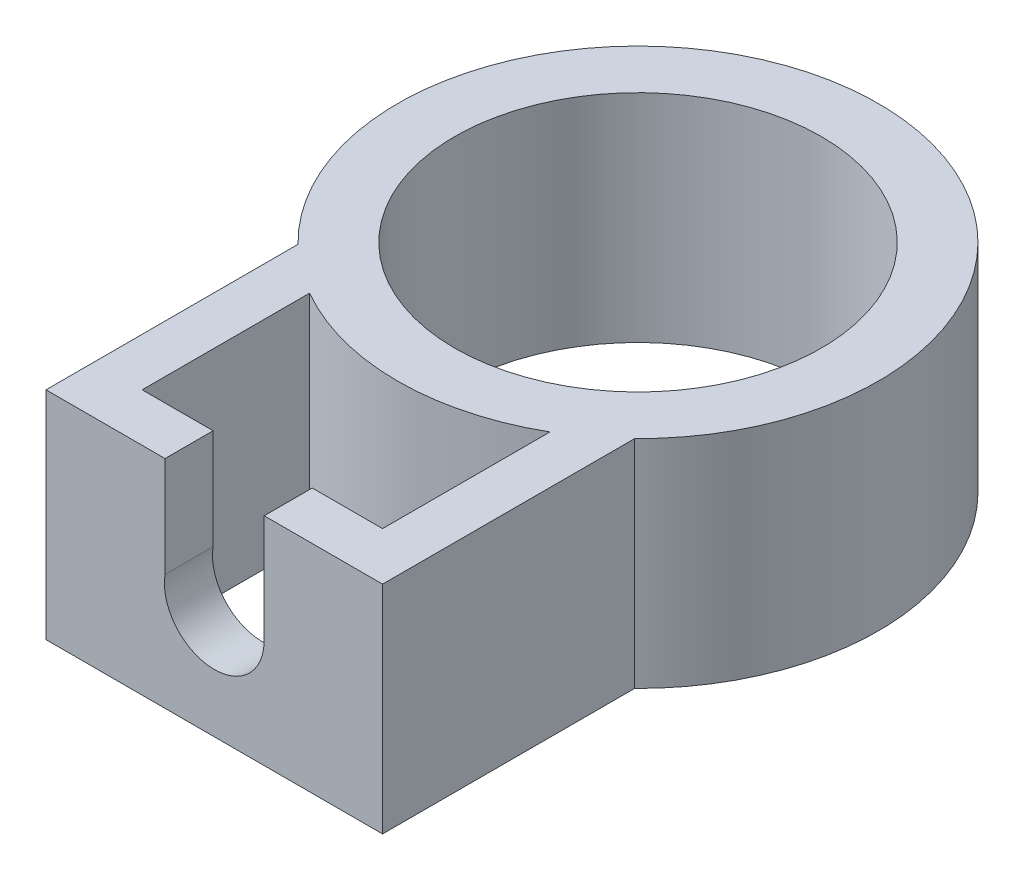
ISO-10303-21;
HEADER;
FILE_DESCRIPTION(('STEP AP214'),'2;1');
FILE_NAME('part.step','',(''),(''),'','','');
FILE_SCHEMA(('AUTOMOTIVE_DESIGN { 1 0 10303 214 1 1 1 1 }'));
ENDSEC;
DATA;
#1=APPLICATION_CONTEXT('core data for automotive mechanical design processes');
#2=APPLICATION_PROTOCOL_DEFINITION('international standard','automotive_design',2000,#1);
#3=PRODUCT_CONTEXT('',#1,'mechanical');
#4=PRODUCT('Part','Part','',(#3));
#5=PRODUCT_RELATED_PRODUCT_CATEGORY('part','',(#4));
#6=PRODUCT_DEFINITION_FORMATION('','',#4);
#7=PRODUCT_DEFINITION_CONTEXT('part definition',#1,'design');
#8=PRODUCT_DEFINITION('design','',#6,#7);
#9=PRODUCT_DEFINITION_SHAPE('','',#8);
#10=(LENGTH_UNIT() NAMED_UNIT(*) SI_UNIT(.MILLI.,.METRE.));
#11=(NAMED_UNIT(*) PLANE_ANGLE_UNIT() SI_UNIT($,.RADIAN.));
#12=(NAMED_UNIT(*) SI_UNIT($,.STERADIAN.) SOLID_ANGLE_UNIT());
#13=UNCERTAINTY_MEASURE_WITH_UNIT(LENGTH_MEASURE(1.E-05),#10,'distance_accuracy_value','');
#14=(GEOMETRIC_REPRESENTATION_CONTEXT(3) GLOBAL_UNCERTAINTY_ASSIGNED_CONTEXT((#13)) GLOBAL_UNIT_ASSIGNED_CONTEXT((#10,
#11,#12)) REPRESENTATION_CONTEXT('',''));
#15=CARTESIAN_POINT('',(0.,0.,0.));
#16=DIRECTION('',(0.,0.,1.));
#17=DIRECTION('',(1.,0.,0.));
#18=AXIS2_PLACEMENT_3D('',#15,#16,#17);
#19=CARTESIAN_POINT('',(0.,18.,0.));
#20=DIRECTION('',(0.,1.,0.));
#21=DIRECTION('',(0.,0.,1.));
#22=AXIS2_PLACEMENT_3D('',#19,#20,#21);
#23=PLANE('',#22);
#24=DIRECTION('',(0.,0.,-1.));
#25=VECTOR('',#24,1.);
#26=CARTESIAN_POINT('',(4.15,18.,0.));
#27=LINE('',#26,#25);
#28=CARTESIAN_POINT('',(4.15,18.,35.25));
#29=VERTEX_POINT('',#28);
#30=CARTESIAN_POINT('',(4.15,18.,31.25));
#31=VERTEX_POINT('',#30);
#32=EDGE_CURVE('E146',#29,#31,#27,.T.);
#33=ORIENTED_EDGE('',*,*,#32,.F.);
#34=DIRECTION('',(1.,0.,0.));
#35=VECTOR('',#34,1.);
#36=CARTESIAN_POINT('',(6.5,18.,35.25));
#37=LINE('',#36,#35);
#38=CARTESIAN_POINT('',(14.,18.,35.25));
#39=VERTEX_POINT('',#38);
#40=EDGE_CURVE('E240',#29,#39,#37,.T.);
#41=ORIENTED_EDGE('',*,*,#40,.T.);
#42=DIRECTION('',(0.,0.,-1.));
#43=VECTOR('',#42,1.);
#44=CARTESIAN_POINT('',(14.,18.,35.25));
#45=LINE('',#44,#43);
#46=CARTESIAN_POINT('',(14.,18.,14.2828568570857));
#47=VERTEX_POINT('',#46);
#48=EDGE_CURVE('E239',#39,#47,#45,.T.);
#49=ORIENTED_EDGE('',*,*,#48,.T.);
#50=CARTESIAN_POINT('',(0.,18.,0.));
#51=DIRECTION('',(0.,1.,0.));
#52=DIRECTION('',(0.,0.,1.));
#53=AXIS2_PLACEMENT_3D('',#50,#51,#52);
#54=CIRCLE('',#53,20.);
#55=CARTESIAN_POINT('',(-14.,18.,14.2828568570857));
#56=VERTEX_POINT('',#55);
#57=EDGE_CURVE('E243',#47,#56,#54,.T.);
#58=ORIENTED_EDGE('',*,*,#57,.T.);
#59=DIRECTION('',(0.,0.,1.));
#60=VECTOR('',#59,1.);
#61=CARTESIAN_POINT('',(-14.,18.,35.25));
#62=LINE('',#61,#60);
#63=CARTESIAN_POINT('',(-14.,18.,35.25));
#64=VERTEX_POINT('',#63);
#65=EDGE_CURVE('E246',#56,#64,#62,.T.);
#66=ORIENTED_EDGE('',*,*,#65,.T.);
#67=CARTESIAN_POINT('',(-4.09784403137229,18.,35.25));
#68=VERTEX_POINT('',#67);
#69=EDGE_CURVE('E235',#64,#68,#37,.T.);
#70=ORIENTED_EDGE('',*,*,#69,.T.);
#71=DIRECTION('',(0.,0.,1.));
#72=VECTOR('',#71,1.);
#73=CARTESIAN_POINT('',(-4.09784403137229,18.,0.));
#74=LINE('',#73,#72);
#75=CARTESIAN_POINT('',(-4.09784403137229,18.,31.25));
#76=VERTEX_POINT('',#75);
#77=EDGE_CURVE('E171',#76,#68,#74,.T.);
#78=ORIENTED_EDGE('',*,*,#77,.F.);
#79=DIRECTION('',(1.,0.,0.));
#80=VECTOR('',#79,1.);
#81=CARTESIAN_POINT('',(-9.99999999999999,18.,31.25));
#82=LINE('',#81,#80);
#83=CARTESIAN_POINT('',(-9.99999999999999,18.,31.25));
#84=VERTEX_POINT('',#83);
#85=EDGE_CURVE('E189',#84,#76,#82,.T.);
#86=ORIENTED_EDGE('',*,*,#85,.F.);
#87=DIRECTION('',(0.,0.,1.));
#88=VECTOR('',#87,1.);
#89=CARTESIAN_POINT('',(-9.99999999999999,18.,31.25));
#90=LINE('',#89,#88);
#91=CARTESIAN_POINT('',(-9.99999999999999,18.,17.3205080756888));
#92=VERTEX_POINT('',#91);
#93=EDGE_CURVE('E184',#92,#84,#90,.T.);
#94=ORIENTED_EDGE('',*,*,#93,.F.);
#95=CARTESIAN_POINT('',(0.,18.,0.));
#96=DIRECTION('',(0.,-1.,0.));
#97=DIRECTION('',(0.,0.,1.));
#98=AXIS2_PLACEMENT_3D('',#95,#96,#97);
#99=CIRCLE('',#98,20.);
#100=CARTESIAN_POINT('',(10.,18.,17.3205080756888));
#101=VERTEX_POINT('',#100);
#102=EDGE_CURVE('E181',#101,#92,#99,.T.);
#103=ORIENTED_EDGE('',*,*,#102,.F.);
#104=DIRECTION('',(0.,0.,-1.));
#105=VECTOR('',#104,1.);
#106=CARTESIAN_POINT('',(10.,18.,31.25));
#107=LINE('',#106,#105);
#108=CARTESIAN_POINT('',(10.,18.,31.25));
#109=VERTEX_POINT('',#108);
#110=EDGE_CURVE('E193',#109,#101,#107,.T.);
#111=ORIENTED_EDGE('',*,*,#110,.F.);
#112=EDGE_CURVE('E188',#31,#109,#82,.T.);
#113=ORIENTED_EDGE('',*,*,#112,.F.);
#114=EDGE_LOOP('',(#33,#41,#49,#58,#66,#70,#78,#86,#94,#103,#111,#113));
#115=FACE_BOUND('',#114,.T.);
#116=CARTESIAN_POINT('',(0.,18.,0.));
#117=DIRECTION('',(0.,1.,0.));
#118=DIRECTION('',(0.,0.,1.));
#119=AXIS2_PLACEMENT_3D('',#116,#117,#118);
#120=CIRCLE('',#119,15.25);
#121=CARTESIAN_POINT('',(0.,18.,15.25));
#122=VERTEX_POINT('',#121);
#123=EDGE_CURVE('E227',#122,#122,#120,.T.);
#124=ORIENTED_EDGE('',*,*,#123,.F.);
#125=EDGE_LOOP('',(#124));
#126=FACE_BOUND('',#125,.T.);
#127=ADVANCED_FACE('F45',(#115,#126),#23,.T.);
#128=CARTESIAN_POINT('',(0.,0.,0.));
#129=DIRECTION('',(0.,1.,0.));
#130=DIRECTION('',(0.,0.,1.));
#131=AXIS2_PLACEMENT_3D('',#128,#129,#130);
#132=PLANE('',#131);
#133=CARTESIAN_POINT('',(0.,0.,0.));
#134=DIRECTION('',(0.,1.,0.));
#135=DIRECTION('',(0.,0.,1.));
#136=AXIS2_PLACEMENT_3D('',#133,#134,#135);
#137=CIRCLE('',#136,15.25);
#138=CARTESIAN_POINT('',(0.,0.,15.25));
#139=VERTEX_POINT('',#138);
#140=EDGE_CURVE('E226',#139,#139,#137,.T.);
#141=ORIENTED_EDGE('',*,*,#140,.T.);
#142=EDGE_LOOP('',(#141));
#143=FACE_BOUND('',#142,.T.);
#144=DIRECTION('',(0.,0.,-1.));
#145=VECTOR('',#144,1.);
#146=CARTESIAN_POINT('',(14.,0.,35.25));
#147=LINE('',#146,#145);
#148=CARTESIAN_POINT('',(14.,0.,35.25));
#149=VERTEX_POINT('',#148);
#150=CARTESIAN_POINT('',(14.,0.,14.2828568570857));
#151=VERTEX_POINT('',#150);
#152=EDGE_CURVE('E231',#149,#151,#147,.T.);
#153=ORIENTED_EDGE('',*,*,#152,.F.);
#154=DIRECTION('',(1.,0.,0.));
#155=VECTOR('',#154,1.);
#156=CARTESIAN_POINT('',(-6.5,0.,35.25));
#157=LINE('',#156,#155);
#158=CARTESIAN_POINT('',(-14.,0.,35.25));
#159=VERTEX_POINT('',#158);
#160=EDGE_CURVE('E260',#159,#149,#157,.T.);
#161=ORIENTED_EDGE('',*,*,#160,.F.);
#162=DIRECTION('',(0.,0.,1.));
#163=VECTOR('',#162,1.);
#164=CARTESIAN_POINT('',(-14.,0.,35.25));
#165=LINE('',#164,#163);
#166=CARTESIAN_POINT('',(-14.,0.,14.2828568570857));
#167=VERTEX_POINT('',#166);
#168=EDGE_CURVE('E256',#167,#159,#165,.T.);
#169=ORIENTED_EDGE('',*,*,#168,.F.);
#170=CARTESIAN_POINT('',(0.,0.,0.));
#171=DIRECTION('',(0.,1.,0.));
#172=DIRECTION('',(0.,0.,1.));
#173=AXIS2_PLACEMENT_3D('',#170,#171,#172);
#174=CIRCLE('',#173,20.);
#175=EDGE_CURVE('E253',#151,#167,#174,.T.);
#176=ORIENTED_EDGE('',*,*,#175,.F.);
#177=EDGE_LOOP('',(#153,#161,#169,#176));
#178=FACE_BOUND('',#177,.T.);
#179=CARTESIAN_POINT('',(0.,0.,0.));
#180=DIRECTION('',(0.,-1.,0.));
#181=DIRECTION('',(0.,0.,1.));
#182=AXIS2_PLACEMENT_3D('',#179,#180,#181);
#183=CIRCLE('',#182,20.);
#184=CARTESIAN_POINT('',(10.,0.,17.3205080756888));
#185=VERTEX_POINT('',#184);
#186=CARTESIAN_POINT('',(-9.99999999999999,0.,17.3205080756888));
#187=VERTEX_POINT('',#186);
#188=EDGE_CURVE('E197',#185,#187,#183,.T.);
#189=ORIENTED_EDGE('',*,*,#188,.T.);
#190=DIRECTION('',(0.,0.,1.));
#191=VECTOR('',#190,1.);
#192=CARTESIAN_POINT('',(-9.99999999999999,0.,31.25));
#193=LINE('',#192,#191);
#194=CARTESIAN_POINT('',(-9.99999999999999,0.,31.25));
#195=VERTEX_POINT('',#194);
#196=EDGE_CURVE('E201',#187,#195,#193,.T.);
#197=ORIENTED_EDGE('',*,*,#196,.T.);
#198=DIRECTION('',(1.,0.,0.));
#199=VECTOR('',#198,1.);
#200=CARTESIAN_POINT('',(6.5,0.,31.25));
#201=LINE('',#200,#199);
#202=CARTESIAN_POINT('',(10.,0.,31.25));
#203=VERTEX_POINT('',#202);
#204=EDGE_CURVE('E205',#195,#203,#201,.T.);
#205=ORIENTED_EDGE('',*,*,#204,.T.);
#206=DIRECTION('',(0.,0.,-1.));
#207=VECTOR('',#206,1.);
#208=CARTESIAN_POINT('',(10.,0.,31.25));
#209=LINE('',#208,#207);
#210=EDGE_CURVE('E185',#203,#185,#209,.T.);
#211=ORIENTED_EDGE('',*,*,#210,.T.);
#212=EDGE_LOOP('',(#189,#197,#205,#211));
#213=FACE_BOUND('',#212,.T.);
#214=ADVANCED_FACE('F302',(#143,#178,#213),#132,.F.);
#215=CARTESIAN_POINT('',(14.,18.,35.25));
#216=DIRECTION('',(-1.,0.,0.));
#217=DIRECTION('',(0.,0.,1.));
#218=AXIS2_PLACEMENT_3D('',#215,#216,#217);
#219=PLANE('',#218);
#220=ORIENTED_EDGE('',*,*,#152,.T.);
#221=DIRECTION('',(0.,-1.,0.));
#222=VECTOR('',#221,1.);
#223=CARTESIAN_POINT('',(14.,18.,14.2828568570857));
#224=LINE('',#223,#222);
#225=EDGE_CURVE('E270',#47,#151,#224,.T.);
#226=ORIENTED_EDGE('',*,*,#225,.F.);
#227=ORIENTED_EDGE('',*,*,#48,.F.);
#228=DIRECTION('',(0.,-1.,0.));
#229=VECTOR('',#228,1.);
#230=CARTESIAN_POINT('',(14.,18.,35.25));
#231=LINE('',#230,#229);
#232=EDGE_CURVE('E274',#39,#149,#231,.T.);
#233=ORIENTED_EDGE('',*,*,#232,.T.);
#234=EDGE_LOOP('',(#220,#226,#227,#233));
#235=FACE_BOUND('',#234,.T.);
#236=ADVANCED_FACE('F47',(#235),#219,.F.);
#237=CARTESIAN_POINT('',(0.,18.,0.));
#238=DIRECTION('',(0.,-1.,0.));
#239=DIRECTION('',(0.,0.,-1.));
#240=AXIS2_PLACEMENT_3D('',#237,#238,#239);
#241=CYLINDRICAL_SURFACE('',#240,20.);
#242=ORIENTED_EDGE('',*,*,#175,.T.);
#243=DIRECTION('',(0.,-1.,0.));
#244=VECTOR('',#243,1.);
#245=CARTESIAN_POINT('',(-14.,18.,14.2828568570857));
#246=LINE('',#245,#244);
#247=EDGE_CURVE('E266',#56,#167,#246,.T.);
#248=ORIENTED_EDGE('',*,*,#247,.F.);
#249=ORIENTED_EDGE('',*,*,#57,.F.);
#250=ORIENTED_EDGE('',*,*,#225,.T.);
#251=EDGE_LOOP('',(#242,#248,#249,#250));
#252=FACE_BOUND('',#251,.T.);
#253=ADVANCED_FACE('F336',(#252),#241,.T.);
#254=CARTESIAN_POINT('',(-14.,18.,35.25));
#255=DIRECTION('',(1.,0.,0.));
#256=DIRECTION('',(0.,0.,-1.));
#257=AXIS2_PLACEMENT_3D('',#254,#255,#256);
#258=PLANE('',#257);
#259=ORIENTED_EDGE('',*,*,#168,.T.);
#260=DIRECTION('',(0.,-1.,0.));
#261=VECTOR('',#260,1.);
#262=CARTESIAN_POINT('',(-14.,18.,35.25));
#263=LINE('',#262,#261);
#264=EDGE_CURVE('E250',#64,#159,#263,.T.);
#265=ORIENTED_EDGE('',*,*,#264,.F.);
#266=ORIENTED_EDGE('',*,*,#65,.F.);
#267=ORIENTED_EDGE('',*,*,#247,.T.);
#268=EDGE_LOOP('',(#259,#265,#266,#267));
#269=FACE_BOUND('',#268,.T.);
#270=ADVANCED_FACE('F334',(#269),#258,.F.);
#271=CARTESIAN_POINT('',(-6.5,18.,35.25));
#272=DIRECTION('',(0.,0.,-1.));
#273=DIRECTION('',(-1.,0.,0.));
#274=AXIS2_PLACEMENT_3D('',#271,#272,#273);
#275=PLANE('',#274);
#276=DIRECTION('',(0.,1.,0.));
#277=VECTOR('',#276,1.);
#278=CARTESIAN_POINT('',(4.15,8.86490624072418,35.25));
#279=LINE('',#278,#277);
#280=CARTESIAN_POINT('',(4.15,8.86490624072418,35.25));
#281=VERTEX_POINT('',#280);
#282=EDGE_CURVE('E163',#281,#29,#279,.T.);
#283=ORIENTED_EDGE('',*,*,#282,.F.);
#284=DIRECTION('',(1.,0.,0.));
#285=VECTOR('',#284,1.);
#286=CARTESIAN_POINT('',(-4.09784403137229,8.86490624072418,35.25));
#287=LINE('',#286,#285);
#288=CARTESIAN_POINT('',(4.14780058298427,8.86490624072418,35.25));
#289=VERTEX_POINT('',#288);
#290=EDGE_CURVE('E154',#289,#281,#287,.T.);
#291=ORIENTED_EDGE('',*,*,#290,.F.);
#292=CARTESIAN_POINT('',(0.,9.00000000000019,35.25));
#293=DIRECTION('',(0.,0.,1.));
#294=DIRECTION('',(1.,0.,0.));
#295=AXIS2_PLACEMENT_3D('',#292,#293,#294);
#296=CIRCLE('',#295,4.15);
#297=CARTESIAN_POINT('',(-4.09784403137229,9.65587673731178,35.25));
#298=VERTEX_POINT('',#297);
#299=EDGE_CURVE('E177',#298,#289,#296,.T.);
#300=ORIENTED_EDGE('',*,*,#299,.F.);
#301=DIRECTION('',(0.,-1.,0.));
#302=VECTOR('',#301,1.);
#303=CARTESIAN_POINT('',(-4.09784403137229,8.86490624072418,35.25));
#304=LINE('',#303,#302);
#305=EDGE_CURVE('E61',#68,#298,#304,.T.);
#306=ORIENTED_EDGE('',*,*,#305,.F.);
#307=ORIENTED_EDGE('',*,*,#69,.F.);
#308=ORIENTED_EDGE('',*,*,#264,.T.);
#309=ORIENTED_EDGE('',*,*,#160,.T.);
#310=ORIENTED_EDGE('',*,*,#232,.F.);
#311=ORIENTED_EDGE('',*,*,#40,.F.);
#312=EDGE_LOOP('',(#283,#291,#300,#306,#307,#308,#309,#310,#311));
#313=FACE_BOUND('',#312,.T.);
#314=ADVANCED_FACE('F284',(#313),#275,.F.);
#315=CARTESIAN_POINT('',(0.,18.,0.));
#316=DIRECTION('',(0.,-1.,0.));
#317=DIRECTION('',(0.,0.,-1.));
#318=AXIS2_PLACEMENT_3D('',#315,#316,#317);
#319=CYLINDRICAL_SURFACE('',#318,15.25);
#320=ORIENTED_EDGE('',*,*,#123,.T.);
#321=EDGE_LOOP('',(#320));
#322=FACE_BOUND('',#321,.T.);
#323=ORIENTED_EDGE('',*,*,#140,.F.);
#324=EDGE_LOOP('',(#323));
#325=FACE_BOUND('',#324,.T.);
#326=ADVANCED_FACE('F330',(#322,#325),#319,.F.);
#327=CARTESIAN_POINT('',(0.,18.,0.));
#328=DIRECTION('',(0.,-1.,0.));
#329=DIRECTION('',(0.,0.,-1.));
#330=AXIS2_PLACEMENT_3D('',#327,#328,#329);
#331=CYLINDRICAL_SURFACE('',#330,20.);
#332=ORIENTED_EDGE('',*,*,#188,.F.);
#333=DIRECTION('',(0.,-1.,0.));
#334=VECTOR('',#333,1.);
#335=CARTESIAN_POINT('',(10.,18.,17.3205080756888));
#336=LINE('',#335,#334);
#337=EDGE_CURVE('E196',#101,#185,#336,.T.);
#338=ORIENTED_EDGE('',*,*,#337,.F.);
#339=ORIENTED_EDGE('',*,*,#102,.T.);
#340=DIRECTION('',(0.,-1.,0.));
#341=VECTOR('',#340,1.);
#342=CARTESIAN_POINT('',(-9.99999999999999,18.,17.3205080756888));
#343=LINE('',#342,#341);
#344=EDGE_CURVE('E222',#92,#187,#343,.T.);
#345=ORIENTED_EDGE('',*,*,#344,.T.);
#346=EDGE_LOOP('',(#332,#338,#339,#345));
#347=FACE_BOUND('',#346,.T.);
#348=ADVANCED_FACE('F395',(#347),#331,.T.);
#349=CARTESIAN_POINT('',(-9.99999999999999,18.,31.25));
#350=DIRECTION('',(1.,0.,0.));
#351=DIRECTION('',(0.,0.,-1.));
#352=AXIS2_PLACEMENT_3D('',#349,#350,#351);
#353=PLANE('',#352);
#354=ORIENTED_EDGE('',*,*,#196,.F.);
#355=ORIENTED_EDGE('',*,*,#344,.F.);
#356=ORIENTED_EDGE('',*,*,#93,.T.);
#357=DIRECTION('',(0.,-1.,0.));
#358=VECTOR('',#357,1.);
#359=CARTESIAN_POINT('',(-9.99999999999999,18.,31.25));
#360=LINE('',#359,#358);
#361=EDGE_CURVE('E218',#84,#195,#360,.T.);
#362=ORIENTED_EDGE('',*,*,#361,.T.);
#363=EDGE_LOOP('',(#354,#355,#356,#362));
#364=FACE_BOUND('',#363,.T.);
#365=ADVANCED_FACE('F306',(#364),#353,.T.);
#366=CARTESIAN_POINT('',(6.5,18.,31.25));
#367=DIRECTION('',(0.,0.,-1.));
#368=DIRECTION('',(-1.,0.,0.));
#369=AXIS2_PLACEMENT_3D('',#366,#367,#368);
#370=PLANE('',#369);
#371=DIRECTION('',(1.,0.,0.));
#372=VECTOR('',#371,1.);
#373=CARTESIAN_POINT('',(-4.09784403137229,8.86490624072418,31.25));
#374=LINE('',#373,#372);
#375=CARTESIAN_POINT('',(4.14780058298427,8.86490624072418,31.25));
#376=VERTEX_POINT('',#375);
#377=CARTESIAN_POINT('',(4.15,8.86490624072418,31.25));
#378=VERTEX_POINT('',#377);
#379=EDGE_CURVE('E69',#376,#378,#374,.T.);
#380=ORIENTED_EDGE('',*,*,#379,.T.);
#381=DIRECTION('',(0.,1.,0.));
#382=VECTOR('',#381,1.);
#383=CARTESIAN_POINT('',(4.15,8.86490624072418,31.25));
#384=LINE('',#383,#382);
#385=EDGE_CURVE('E141',#378,#31,#384,.T.);
#386=ORIENTED_EDGE('',*,*,#385,.T.);
#387=ORIENTED_EDGE('',*,*,#112,.T.);
#388=DIRECTION('',(0.,-1.,0.));
#389=VECTOR('',#388,1.);
#390=CARTESIAN_POINT('',(10.,18.,31.25));
#391=LINE('',#390,#389);
#392=EDGE_CURVE('E215',#109,#203,#391,.T.);
#393=ORIENTED_EDGE('',*,*,#392,.T.);
#394=ORIENTED_EDGE('',*,*,#204,.F.);
#395=ORIENTED_EDGE('',*,*,#361,.F.);
#396=ORIENTED_EDGE('',*,*,#85,.T.);
#397=DIRECTION('',(0.,-1.,0.));
#398=VECTOR('',#397,1.);
#399=CARTESIAN_POINT('',(-4.09784403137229,8.86490624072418,31.25));
#400=LINE('',#399,#398);
#401=CARTESIAN_POINT('',(-4.09784403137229,9.65587673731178,31.25));
#402=VERTEX_POINT('',#401);
#403=EDGE_CURVE('E150',#76,#402,#400,.T.);
#404=ORIENTED_EDGE('',*,*,#403,.T.);
#405=CARTESIAN_POINT('',(0.,9.00000000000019,31.25));
#406=DIRECTION('',(0.,0.,-1.));
#407=DIRECTION('',(-1.,0.,0.));
#408=AXIS2_PLACEMENT_3D('',#405,#406,#407);
#409=CIRCLE('',#408,4.15);
#410=EDGE_CURVE('E161',#376,#402,#409,.T.);
#411=ORIENTED_EDGE('',*,*,#410,.F.);
#412=EDGE_LOOP('',(#380,#386,#387,#393,#394,#395,#396,#404,#411));
#413=FACE_BOUND('',#412,.T.);
#414=ADVANCED_FACE('F158',(#413),#370,.T.);
#415=CARTESIAN_POINT('',(10.,18.,31.25));
#416=DIRECTION('',(-1.,0.,0.));
#417=DIRECTION('',(0.,0.,1.));
#418=AXIS2_PLACEMENT_3D('',#415,#416,#417);
#419=PLANE('',#418);
#420=ORIENTED_EDGE('',*,*,#210,.F.);
#421=ORIENTED_EDGE('',*,*,#392,.F.);
#422=ORIENTED_EDGE('',*,*,#110,.T.);
#423=ORIENTED_EDGE('',*,*,#337,.T.);
#424=EDGE_LOOP('',(#420,#421,#422,#423));
#425=FACE_BOUND('',#424,.T.);
#426=ADVANCED_FACE('F299',(#425),#419,.T.);
#427=CARTESIAN_POINT('',(0.,9.00000000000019,25.25));
#428=DIRECTION('',(0.,0.,1.));
#429=DIRECTION('',(1.,0.,0.));
#430=AXIS2_PLACEMENT_3D('',#427,#428,#429);
#431=CYLINDRICAL_SURFACE('',#430,4.15);
#432=ORIENTED_EDGE('',*,*,#299,.T.);
#433=DIRECTION('',(0.,0.,1.));
#434=VECTOR('',#433,1.);
#435=CARTESIAN_POINT('',(4.14780058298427,8.86490624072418,25.25));
#436=LINE('',#435,#434);
#437=EDGE_CURVE('E11',#289,#376,#436,.F.);
#438=ORIENTED_EDGE('',*,*,#437,.T.);
#439=ORIENTED_EDGE('',*,*,#410,.T.);
#440=DIRECTION('',(0.,0.,1.));
#441=VECTOR('',#440,1.);
#442=CARTESIAN_POINT('',(-4.09784403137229,9.65587673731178,25.25));
#443=LINE('',#442,#441);
#444=EDGE_CURVE('E54',#402,#298,#443,.T.);
#445=ORIENTED_EDGE('',*,*,#444,.T.);
#446=EDGE_LOOP('',(#432,#438,#439,#445));
#447=FACE_BOUND('',#446,.T.);
#448=ADVANCED_FACE('F282',(#447),#431,.F.);
#449=CARTESIAN_POINT('',(-4.09784403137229,8.86490624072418,18.6339391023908));
#450=DIRECTION('',(-1.,0.,0.));
#451=DIRECTION('',(0.,0.,1.));
#452=AXIS2_PLACEMENT_3D('',#449,#450,#451);
#453=PLANE('',#452);
#454=ORIENTED_EDGE('',*,*,#77,.T.);
#455=ORIENTED_EDGE('',*,*,#305,.T.);
#456=ORIENTED_EDGE('',*,*,#444,.F.);
#457=ORIENTED_EDGE('',*,*,#403,.F.);
#458=EDGE_LOOP('',(#454,#455,#456,#457));
#459=FACE_BOUND('',#458,.T.);
#460=ADVANCED_FACE('F310',(#459),#453,.F.);
#461=CARTESIAN_POINT('',(-4.09784403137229,8.86490624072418,18.6339391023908));
#462=DIRECTION('',(0.,-1.,0.));
#463=DIRECTION('',(0.,0.,-1.));
#464=AXIS2_PLACEMENT_3D('',#461,#462,#463);
#465=PLANE('',#464);
#466=ORIENTED_EDGE('',*,*,#290,.T.);
#467=DIRECTION('',(0.,0.,1.));
#468=VECTOR('',#467,1.);
#469=CARTESIAN_POINT('',(4.15,8.86490624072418,18.6339391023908));
#470=LINE('',#469,#468);
#471=EDGE_CURVE('E143',#378,#281,#470,.T.);
#472=ORIENTED_EDGE('',*,*,#471,.F.);
#473=ORIENTED_EDGE('',*,*,#379,.F.);
#474=ORIENTED_EDGE('',*,*,#437,.F.);
#475=EDGE_LOOP('',(#466,#472,#473,#474));
#476=FACE_BOUND('',#475,.T.);
#477=ADVANCED_FACE('F152',(#476),#465,.F.);
#478=CARTESIAN_POINT('',(4.15,8.86490624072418,18.6339391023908));
#479=DIRECTION('',(1.,0.,0.));
#480=DIRECTION('',(0.,0.,-1.));
#481=AXIS2_PLACEMENT_3D('',#478,#479,#480);
#482=PLANE('',#481);
#483=ORIENTED_EDGE('',*,*,#32,.T.);
#484=ORIENTED_EDGE('',*,*,#385,.F.);
#485=ORIENTED_EDGE('',*,*,#471,.T.);
#486=ORIENTED_EDGE('',*,*,#282,.T.);
#487=EDGE_LOOP('',(#483,#484,#485,#486));
#488=FACE_BOUND('',#487,.T.);
#489=ADVANCED_FACE('F142',(#488),#482,.F.);
#490=CLOSED_SHELL('',(#127,#214,#236,#253,#270,#314,#326,#348,#365,#414,#426,#448,#460,#477,#489));
#491=MANIFOLD_SOLID_BREP('B2',#490);
#492=ADVANCED_BREP_SHAPE_REPRESENTATION('',(#18,#491),#14);
#493=SHAPE_DEFINITION_REPRESENTATION(#9,#492);
ENDSEC;
END-ISO-10303-21;
